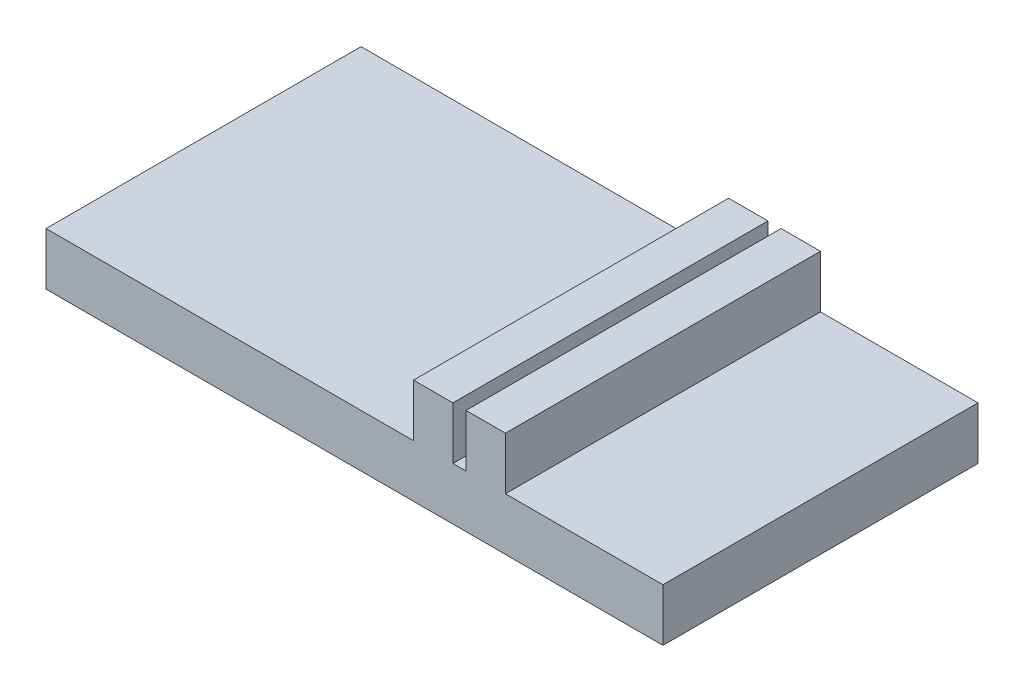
ISO-10303-21;
HEADER;
FILE_DESCRIPTION(('STEP AP214'),'2;1');
FILE_NAME('part.step','',(''),(''),'','','');
FILE_SCHEMA(('AUTOMOTIVE_DESIGN { 1 0 10303 214 1 1 1 1 }'));
ENDSEC;
DATA;
#1=APPLICATION_CONTEXT('core data for automotive mechanical design processes');
#2=APPLICATION_PROTOCOL_DEFINITION('international standard','automotive_design',2000,#1);
#3=PRODUCT_CONTEXT('',#1,'mechanical');
#4=PRODUCT('Part','Part','',(#3));
#5=PRODUCT_RELATED_PRODUCT_CATEGORY('part','',(#4));
#6=PRODUCT_DEFINITION_FORMATION('','',#4);
#7=PRODUCT_DEFINITION_CONTEXT('part definition',#1,'design');
#8=PRODUCT_DEFINITION('design','',#6,#7);
#9=PRODUCT_DEFINITION_SHAPE('','',#8);
#10=(LENGTH_UNIT() NAMED_UNIT(*) SI_UNIT(.MILLI.,.METRE.));
#11=(NAMED_UNIT(*) PLANE_ANGLE_UNIT() SI_UNIT($,.RADIAN.));
#12=(NAMED_UNIT(*) SI_UNIT($,.STERADIAN.) SOLID_ANGLE_UNIT());
#13=UNCERTAINTY_MEASURE_WITH_UNIT(LENGTH_MEASURE(1.E-05),#10,'distance_accuracy_value','');
#14=(GEOMETRIC_REPRESENTATION_CONTEXT(3) GLOBAL_UNCERTAINTY_ASSIGNED_CONTEXT((#13)) GLOBAL_UNIT_ASSIGNED_CONTEXT((#10,
#11,#12)) REPRESENTATION_CONTEXT('',''));
#15=CARTESIAN_POINT('',(0.,0.,0.));
#16=DIRECTION('',(0.,0.,1.));
#17=DIRECTION('',(1.,0.,0.));
#18=AXIS2_PLACEMENT_3D('',#15,#16,#17);
#19=CARTESIAN_POINT('',(0.,25.4,152.4));
#20=DIRECTION('',(1.,0.,0.));
#21=DIRECTION('',(0.,1.,0.));
#22=AXIS2_PLACEMENT_3D('',#19,#20,#21);
#23=PLANE('',#22);
#24=DIRECTION('',(0.,-1.,0.));
#25=VECTOR('',#24,1.);
#26=CARTESIAN_POINT('',(0.,25.4,0.));
#27=LINE('',#26,#25);
#28=CARTESIAN_POINT('',(0.,25.4,0.));
#29=VERTEX_POINT('',#28);
#30=CARTESIAN_POINT('',(0.,0.,0.));
#31=VERTEX_POINT('',#30);
#32=EDGE_CURVE('E153',#29,#31,#27,.T.);
#33=ORIENTED_EDGE('',*,*,#32,.T.);
#34=DIRECTION('',(0.,0.,-1.));
#35=VECTOR('',#34,1.);
#36=CARTESIAN_POINT('',(0.,0.,152.4));
#37=LINE('',#36,#35);
#38=CARTESIAN_POINT('',(0.,0.,152.4));
#39=VERTEX_POINT('',#38);
#40=EDGE_CURVE('E11',#39,#31,#37,.T.);
#41=ORIENTED_EDGE('',*,*,#40,.F.);
#42=DIRECTION('',(0.,-1.,0.));
#43=VECTOR('',#42,1.);
#44=CARTESIAN_POINT('',(0.,25.4,152.4));
#45=LINE('',#44,#43);
#46=CARTESIAN_POINT('',(0.,25.4,152.4));
#47=VERTEX_POINT('',#46);
#48=EDGE_CURVE('E175',#47,#39,#45,.T.);
#49=ORIENTED_EDGE('',*,*,#48,.F.);
#50=DIRECTION('',(0.,0.,-1.));
#51=VECTOR('',#50,1.);
#52=CARTESIAN_POINT('',(0.,25.4,152.4));
#53=LINE('',#52,#51);
#54=EDGE_CURVE('E149',#47,#29,#53,.T.);
#55=ORIENTED_EDGE('',*,*,#54,.T.);
#56=EDGE_LOOP('',(#33,#41,#49,#55));
#57=FACE_BOUND('',#56,.T.);
#58=ADVANCED_FACE('F33',(#57),#23,.F.);
#59=CARTESIAN_POINT('',(0.,0.,152.4));
#60=DIRECTION('',(0.,1.,0.));
#61=DIRECTION('',(0.,0.,1.));
#62=AXIS2_PLACEMENT_3D('',#59,#60,#61);
#63=PLANE('',#62);
#64=DIRECTION('',(1.,0.,0.));
#65=VECTOR('',#64,1.);
#66=CARTESIAN_POINT('',(0.,0.,0.));
#67=LINE('',#66,#65);
#68=CARTESIAN_POINT('',(298.45,0.,0.));
#69=VERTEX_POINT('',#68);
#70=EDGE_CURVE('E156',#31,#69,#67,.T.);
#71=ORIENTED_EDGE('',*,*,#70,.T.);
#72=DIRECTION('',(0.,0.,-1.));
#73=VECTOR('',#72,1.);
#74=CARTESIAN_POINT('',(298.45,0.,152.4));
#75=LINE('',#74,#73);
#76=CARTESIAN_POINT('',(298.45,0.,152.4));
#77=VERTEX_POINT('',#76);
#78=EDGE_CURVE('E41',#77,#69,#75,.T.);
#79=ORIENTED_EDGE('',*,*,#78,.F.);
#80=DIRECTION('',(1.,0.,0.));
#81=VECTOR('',#80,1.);
#82=CARTESIAN_POINT('',(0.,0.,152.4));
#83=LINE('',#82,#81);
#84=EDGE_CURVE('E104',#39,#77,#83,.T.);
#85=ORIENTED_EDGE('',*,*,#84,.F.);
#86=ORIENTED_EDGE('',*,*,#40,.T.);
#87=EDGE_LOOP('',(#71,#79,#85,#86));
#88=FACE_BOUND('',#87,.T.);
#89=ADVANCED_FACE('F253',(#88),#63,.F.);
#90=CARTESIAN_POINT('',(298.45,0.,152.4));
#91=DIRECTION('',(-1.,0.,0.));
#92=DIRECTION('',(0.,0.,1.));
#93=AXIS2_PLACEMENT_3D('',#90,#91,#92);
#94=PLANE('',#93);
#95=DIRECTION('',(0.,1.,0.));
#96=VECTOR('',#95,1.);
#97=CARTESIAN_POINT('',(298.45,0.,0.));
#98=LINE('',#97,#96);
#99=CARTESIAN_POINT('',(298.45,25.4,0.));
#100=VERTEX_POINT('',#99);
#101=EDGE_CURVE('E158',#69,#100,#98,.T.);
#102=ORIENTED_EDGE('',*,*,#101,.T.);
#103=DIRECTION('',(0.,0.,-1.));
#104=VECTOR('',#103,1.);
#105=CARTESIAN_POINT('',(298.45,25.4,152.4));
#106=LINE('',#105,#104);
#107=CARTESIAN_POINT('',(298.45,25.4,152.4));
#108=VERTEX_POINT('',#107);
#109=EDGE_CURVE('E194',#108,#100,#106,.T.);
#110=ORIENTED_EDGE('',*,*,#109,.F.);
#111=DIRECTION('',(0.,1.,0.));
#112=VECTOR('',#111,1.);
#113=CARTESIAN_POINT('',(298.45,0.,152.4));
#114=LINE('',#113,#112);
#115=EDGE_CURVE('E202',#77,#108,#114,.T.);
#116=ORIENTED_EDGE('',*,*,#115,.F.);
#117=ORIENTED_EDGE('',*,*,#78,.T.);
#118=EDGE_LOOP('',(#102,#110,#116,#117));
#119=FACE_BOUND('',#118,.T.);
#120=ADVANCED_FACE('F200',(#119),#94,.F.);
#121=CARTESIAN_POINT('',(298.45,25.4,152.4));
#122=DIRECTION('',(0.,-1.,0.));
#123=DIRECTION('',(1.,0.,0.));
#124=AXIS2_PLACEMENT_3D('',#121,#122,#123);
#125=PLANE('',#124);
#126=DIRECTION('',(-1.,0.,0.));
#127=VECTOR('',#126,1.);
#128=CARTESIAN_POINT('',(298.45,25.4,0.));
#129=LINE('',#128,#127);
#130=CARTESIAN_POINT('',(222.25,25.4,0.));
#131=VERTEX_POINT('',#130);
#132=EDGE_CURVE('E160',#100,#131,#129,.T.);
#133=ORIENTED_EDGE('',*,*,#132,.T.);
#134=DIRECTION('',(0.,0.,-1.));
#135=VECTOR('',#134,1.);
#136=CARTESIAN_POINT('',(222.25,25.4,152.4));
#137=LINE('',#136,#135);
#138=CARTESIAN_POINT('',(222.25,25.4,152.4));
#139=VERTEX_POINT('',#138);
#140=EDGE_CURVE('E191',#139,#131,#137,.T.);
#141=ORIENTED_EDGE('',*,*,#140,.F.);
#142=DIRECTION('',(-1.,0.,0.));
#143=VECTOR('',#142,1.);
#144=CARTESIAN_POINT('',(298.45,25.4,152.4));
#145=LINE('',#144,#143);
#146=EDGE_CURVE('E220',#108,#139,#145,.T.);
#147=ORIENTED_EDGE('',*,*,#146,.F.);
#148=ORIENTED_EDGE('',*,*,#109,.T.);
#149=EDGE_LOOP('',(#133,#141,#147,#148));
#150=FACE_BOUND('',#149,.T.);
#151=ADVANCED_FACE('F211',(#150),#125,.F.);
#152=CARTESIAN_POINT('',(222.25,25.4,152.4));
#153=DIRECTION('',(-1.,0.,0.));
#154=DIRECTION('',(0.,-1.,0.));
#155=AXIS2_PLACEMENT_3D('',#152,#153,#154);
#156=PLANE('',#155);
#157=DIRECTION('',(0.,1.,0.));
#158=VECTOR('',#157,1.);
#159=CARTESIAN_POINT('',(222.25,25.4,0.));
#160=LINE('',#159,#158);
#161=CARTESIAN_POINT('',(222.25,50.8,0.));
#162=VERTEX_POINT('',#161);
#163=EDGE_CURVE('E162',#131,#162,#160,.T.);
#164=ORIENTED_EDGE('',*,*,#163,.T.);
#165=DIRECTION('',(0.,0.,-1.));
#166=VECTOR('',#165,1.);
#167=CARTESIAN_POINT('',(222.25,50.8,152.4));
#168=LINE('',#167,#166);
#169=CARTESIAN_POINT('',(222.25,50.8,152.4));
#170=VERTEX_POINT('',#169);
#171=EDGE_CURVE('E188',#170,#162,#168,.T.);
#172=ORIENTED_EDGE('',*,*,#171,.F.);
#173=DIRECTION('',(0.,1.,0.));
#174=VECTOR('',#173,1.);
#175=CARTESIAN_POINT('',(222.25,25.4,152.4));
#176=LINE('',#175,#174);
#177=EDGE_CURVE('E217',#139,#170,#176,.T.);
#178=ORIENTED_EDGE('',*,*,#177,.F.);
#179=ORIENTED_EDGE('',*,*,#140,.T.);
#180=EDGE_LOOP('',(#164,#172,#178,#179));
#181=FACE_BOUND('',#180,.T.);
#182=ADVANCED_FACE('F215',(#181),#156,.F.);
#183=CARTESIAN_POINT('',(222.25,50.8,152.4));
#184=DIRECTION('',(0.,-1.,0.));
#185=DIRECTION('',(1.,0.,0.));
#186=AXIS2_PLACEMENT_3D('',#183,#184,#185);
#187=PLANE('',#186);
#188=DIRECTION('',(-1.,0.,0.));
#189=VECTOR('',#188,1.);
#190=CARTESIAN_POINT('',(222.25,50.8,0.));
#191=LINE('',#190,#189);
#192=CARTESIAN_POINT('',(203.2,50.8,0.));
#193=VERTEX_POINT('',#192);
#194=EDGE_CURVE('E164',#162,#193,#191,.T.);
#195=ORIENTED_EDGE('',*,*,#194,.T.);
#196=DIRECTION('',(0.,0.,-1.));
#197=VECTOR('',#196,1.);
#198=CARTESIAN_POINT('',(203.2,50.8,152.4));
#199=LINE('',#198,#197);
#200=CARTESIAN_POINT('',(203.2,50.8,152.4));
#201=VERTEX_POINT('',#200);
#202=EDGE_CURVE('E185',#201,#193,#199,.T.);
#203=ORIENTED_EDGE('',*,*,#202,.F.);
#204=DIRECTION('',(-1.,0.,0.));
#205=VECTOR('',#204,1.);
#206=CARTESIAN_POINT('',(222.25,50.8,152.4));
#207=LINE('',#206,#205);
#208=EDGE_CURVE('E219',#170,#201,#207,.T.);
#209=ORIENTED_EDGE('',*,*,#208,.F.);
#210=ORIENTED_EDGE('',*,*,#171,.T.);
#211=EDGE_LOOP('',(#195,#203,#209,#210));
#212=FACE_BOUND('',#211,.T.);
#213=ADVANCED_FACE('F266',(#212),#187,.F.);
#214=CARTESIAN_POINT('',(203.2,50.8,152.4));
#215=DIRECTION('',(1.,0.,0.));
#216=DIRECTION('',(0.,0.,-1.));
#217=AXIS2_PLACEMENT_3D('',#214,#215,#216);
#218=PLANE('',#217);
#219=DIRECTION('',(0.,-1.,0.));
#220=VECTOR('',#219,1.);
#221=CARTESIAN_POINT('',(203.2,50.8,0.));
#222=LINE('',#221,#220);
#223=CARTESIAN_POINT('',(203.2,25.4,0.));
#224=VERTEX_POINT('',#223);
#225=EDGE_CURVE('E166',#193,#224,#222,.T.);
#226=ORIENTED_EDGE('',*,*,#225,.T.);
#227=DIRECTION('',(0.,0.,-1.));
#228=VECTOR('',#227,1.);
#229=CARTESIAN_POINT('',(203.2,25.4,152.4));
#230=LINE('',#229,#228);
#231=CARTESIAN_POINT('',(203.2,25.4,152.4));
#232=VERTEX_POINT('',#231);
#233=EDGE_CURVE('E182',#232,#224,#230,.T.);
#234=ORIENTED_EDGE('',*,*,#233,.F.);
#235=DIRECTION('',(0.,-1.,0.));
#236=VECTOR('',#235,1.);
#237=CARTESIAN_POINT('',(203.2,50.8,152.4));
#238=LINE('',#237,#236);
#239=EDGE_CURVE('E222',#201,#232,#238,.T.);
#240=ORIENTED_EDGE('',*,*,#239,.F.);
#241=ORIENTED_EDGE('',*,*,#202,.T.);
#242=EDGE_LOOP('',(#226,#234,#240,#241));
#243=FACE_BOUND('',#242,.T.);
#244=ADVANCED_FACE('F269',(#243),#218,.F.);
#245=CARTESIAN_POINT('',(203.2,25.4,152.4));
#246=DIRECTION('',(0.,-1.,0.));
#247=DIRECTION('',(0.,0.,-1.));
#248=AXIS2_PLACEMENT_3D('',#245,#246,#247);
#249=PLANE('',#248);
#250=DIRECTION('',(-1.,0.,0.));
#251=VECTOR('',#250,1.);
#252=CARTESIAN_POINT('',(203.2,25.4,0.));
#253=LINE('',#252,#251);
#254=CARTESIAN_POINT('',(196.85,25.4,0.));
#255=VERTEX_POINT('',#254);
#256=EDGE_CURVE('E168',#224,#255,#253,.T.);
#257=ORIENTED_EDGE('',*,*,#256,.T.);
#258=DIRECTION('',(0.,0.,-1.));
#259=VECTOR('',#258,1.);
#260=CARTESIAN_POINT('',(196.85,25.4,152.4));
#261=LINE('',#260,#259);
#262=CARTESIAN_POINT('',(196.85,25.4,152.4));
#263=VERTEX_POINT('',#262);
#264=EDGE_CURVE('E179',#263,#255,#261,.T.);
#265=ORIENTED_EDGE('',*,*,#264,.F.);
#266=DIRECTION('',(-1.,0.,0.));
#267=VECTOR('',#266,1.);
#268=CARTESIAN_POINT('',(203.2,25.4,152.4));
#269=LINE('',#268,#267);
#270=EDGE_CURVE('E228',#232,#263,#269,.T.);
#271=ORIENTED_EDGE('',*,*,#270,.F.);
#272=ORIENTED_EDGE('',*,*,#233,.T.);
#273=EDGE_LOOP('',(#257,#265,#271,#272));
#274=FACE_BOUND('',#273,.T.);
#275=ADVANCED_FACE('F234',(#274),#249,.F.);
#276=CARTESIAN_POINT('',(196.85,25.4,152.4));
#277=DIRECTION('',(-1.,0.,0.));
#278=DIRECTION('',(0.,0.,1.));
#279=AXIS2_PLACEMENT_3D('',#276,#277,#278);
#280=PLANE('',#279);
#281=DIRECTION('',(0.,1.,0.));
#282=VECTOR('',#281,1.);
#283=CARTESIAN_POINT('',(196.85,25.4,0.));
#284=LINE('',#283,#282);
#285=CARTESIAN_POINT('',(196.85,50.8,0.));
#286=VERTEX_POINT('',#285);
#287=EDGE_CURVE('E170',#255,#286,#284,.T.);
#288=ORIENTED_EDGE('',*,*,#287,.T.);
#289=DIRECTION('',(0.,0.,-1.));
#290=VECTOR('',#289,1.);
#291=CARTESIAN_POINT('',(196.85,50.8,152.4));
#292=LINE('',#291,#290);
#293=CARTESIAN_POINT('',(196.85,50.8,152.4));
#294=VERTEX_POINT('',#293);
#295=EDGE_CURVE('E144',#294,#286,#292,.T.);
#296=ORIENTED_EDGE('',*,*,#295,.F.);
#297=DIRECTION('',(0.,1.,0.));
#298=VECTOR('',#297,1.);
#299=CARTESIAN_POINT('',(196.85,25.4,152.4));
#300=LINE('',#299,#298);
#301=EDGE_CURVE('E135',#263,#294,#300,.T.);
#302=ORIENTED_EDGE('',*,*,#301,.F.);
#303=ORIENTED_EDGE('',*,*,#264,.T.);
#304=EDGE_LOOP('',(#288,#296,#302,#303));
#305=FACE_BOUND('',#304,.T.);
#306=ADVANCED_FACE('F238',(#305),#280,.F.);
#307=CARTESIAN_POINT('',(196.85,50.8,152.4));
#308=DIRECTION('',(0.,-1.,0.));
#309=DIRECTION('',(1.,0.,0.));
#310=AXIS2_PLACEMENT_3D('',#307,#308,#309);
#311=PLANE('',#310);
#312=DIRECTION('',(-1.,0.,0.));
#313=VECTOR('',#312,1.);
#314=CARTESIAN_POINT('',(196.85,50.8,0.));
#315=LINE('',#314,#313);
#316=CARTESIAN_POINT('',(177.8,50.8,0.));
#317=VERTEX_POINT('',#316);
#318=EDGE_CURVE('E143',#286,#317,#315,.T.);
#319=ORIENTED_EDGE('',*,*,#318,.T.);
#320=DIRECTION('',(0.,0.,-1.));
#321=VECTOR('',#320,1.);
#322=CARTESIAN_POINT('',(177.8,50.8,152.4));
#323=LINE('',#322,#321);
#324=CARTESIAN_POINT('',(177.8,50.8,152.4));
#325=VERTEX_POINT('',#324);
#326=EDGE_CURVE('E140',#325,#317,#323,.T.);
#327=ORIENTED_EDGE('',*,*,#326,.F.);
#328=DIRECTION('',(-1.,0.,0.));
#329=VECTOR('',#328,1.);
#330=CARTESIAN_POINT('',(196.85,50.8,152.4));
#331=LINE('',#330,#329);
#332=EDGE_CURVE('E129',#294,#325,#331,.T.);
#333=ORIENTED_EDGE('',*,*,#332,.F.);
#334=ORIENTED_EDGE('',*,*,#295,.T.);
#335=EDGE_LOOP('',(#319,#327,#333,#334));
#336=FACE_BOUND('',#335,.T.);
#337=ADVANCED_FACE('F141',(#336),#311,.F.);
#338=CARTESIAN_POINT('',(177.8,50.8,152.4));
#339=DIRECTION('',(1.,0.,0.));
#340=DIRECTION('',(0.,1.,0.));
#341=AXIS2_PLACEMENT_3D('',#338,#339,#340);
#342=PLANE('',#341);
#343=DIRECTION('',(0.,-1.,0.));
#344=VECTOR('',#343,1.);
#345=CARTESIAN_POINT('',(177.8,50.8,0.));
#346=LINE('',#345,#344);
#347=CARTESIAN_POINT('',(177.8,25.4,0.));
#348=VERTEX_POINT('',#347);
#349=EDGE_CURVE('E90',#317,#348,#346,.T.);
#350=ORIENTED_EDGE('',*,*,#349,.T.);
#351=DIRECTION('',(0.,0.,-1.));
#352=VECTOR('',#351,1.);
#353=CARTESIAN_POINT('',(177.8,25.4,152.4));
#354=LINE('',#353,#352);
#355=CARTESIAN_POINT('',(177.8,25.4,152.4));
#356=VERTEX_POINT('',#355);
#357=EDGE_CURVE('E145',#356,#348,#354,.T.);
#358=ORIENTED_EDGE('',*,*,#357,.F.);
#359=DIRECTION('',(0.,-1.,0.));
#360=VECTOR('',#359,1.);
#361=CARTESIAN_POINT('',(177.8,50.8,152.4));
#362=LINE('',#361,#360);
#363=EDGE_CURVE('E133',#325,#356,#362,.T.);
#364=ORIENTED_EDGE('',*,*,#363,.F.);
#365=ORIENTED_EDGE('',*,*,#326,.T.);
#366=EDGE_LOOP('',(#350,#358,#364,#365));
#367=FACE_BOUND('',#366,.T.);
#368=ADVANCED_FACE('F147',(#367),#342,.F.);
#369=CARTESIAN_POINT('',(177.8,25.4,152.4));
#370=DIRECTION('',(0.,-1.,0.));
#371=DIRECTION('',(1.,0.,0.));
#372=AXIS2_PLACEMENT_3D('',#369,#370,#371);
#373=PLANE('',#372);
#374=DIRECTION('',(-1.,0.,0.));
#375=VECTOR('',#374,1.);
#376=CARTESIAN_POINT('',(177.8,25.4,0.));
#377=LINE('',#376,#375);
#378=EDGE_CURVE('E96',#348,#29,#377,.T.);
#379=ORIENTED_EDGE('',*,*,#378,.T.);
#380=ORIENTED_EDGE('',*,*,#54,.F.);
#381=DIRECTION('',(-1.,0.,0.));
#382=VECTOR('',#381,1.);
#383=CARTESIAN_POINT('',(177.8,25.4,152.4));
#384=LINE('',#383,#382);
#385=EDGE_CURVE('E49',#356,#47,#384,.T.);
#386=ORIENTED_EDGE('',*,*,#385,.F.);
#387=ORIENTED_EDGE('',*,*,#357,.T.);
#388=EDGE_LOOP('',(#379,#380,#386,#387));
#389=FACE_BOUND('',#388,.T.);
#390=ADVANCED_FACE('F242',(#389),#373,.F.);
#391=CARTESIAN_POINT('',(0.,0.,152.4));
#392=DIRECTION('',(0.,0.,1.));
#393=DIRECTION('',(1.,0.,0.));
#394=AXIS2_PLACEMENT_3D('',#391,#392,#393);
#395=PLANE('',#394);
#396=ORIENTED_EDGE('',*,*,#48,.T.);
#397=ORIENTED_EDGE('',*,*,#84,.T.);
#398=ORIENTED_EDGE('',*,*,#115,.T.);
#399=ORIENTED_EDGE('',*,*,#146,.T.);
#400=ORIENTED_EDGE('',*,*,#177,.T.);
#401=ORIENTED_EDGE('',*,*,#208,.T.);
#402=ORIENTED_EDGE('',*,*,#239,.T.);
#403=ORIENTED_EDGE('',*,*,#270,.T.);
#404=ORIENTED_EDGE('',*,*,#301,.T.);
#405=ORIENTED_EDGE('',*,*,#332,.T.);
#406=ORIENTED_EDGE('',*,*,#363,.T.);
#407=ORIENTED_EDGE('',*,*,#385,.T.);
#408=EDGE_LOOP('',(#396,#397,#398,#399,#400,#401,#402,#403,#404,#405,#406,#407));
#409=FACE_BOUND('',#408,.T.);
#410=ADVANCED_FACE('F131',(#409),#395,.T.);
#411=CARTESIAN_POINT('',(0.,0.,0.));
#412=DIRECTION('',(0.,0.,1.));
#413=DIRECTION('',(1.,0.,0.));
#414=AXIS2_PLACEMENT_3D('',#411,#412,#413);
#415=PLANE('',#414);
#416=ORIENTED_EDGE('',*,*,#32,.F.);
#417=ORIENTED_EDGE('',*,*,#378,.F.);
#418=ORIENTED_EDGE('',*,*,#349,.F.);
#419=ORIENTED_EDGE('',*,*,#318,.F.);
#420=ORIENTED_EDGE('',*,*,#287,.F.);
#421=ORIENTED_EDGE('',*,*,#256,.F.);
#422=ORIENTED_EDGE('',*,*,#225,.F.);
#423=ORIENTED_EDGE('',*,*,#194,.F.);
#424=ORIENTED_EDGE('',*,*,#163,.F.);
#425=ORIENTED_EDGE('',*,*,#132,.F.);
#426=ORIENTED_EDGE('',*,*,#101,.F.);
#427=ORIENTED_EDGE('',*,*,#70,.F.);
#428=EDGE_LOOP('',(#416,#417,#418,#419,#420,#421,#422,#423,#424,#425,#426,#427));
#429=FACE_BOUND('',#428,.T.);
#430=ADVANCED_FACE('F206',(#429),#415,.F.);
#431=CLOSED_SHELL('',(#58,#89,#120,#151,#182,#213,#244,#275,#306,#337,#368,#390,#410,#430));
#432=MANIFOLD_SOLID_BREP('B2',#431);
#433=ADVANCED_BREP_SHAPE_REPRESENTATION('',(#18,#432),#14);
#434=SHAPE_DEFINITION_REPRESENTATION(#9,#433);
ENDSEC;
END-ISO-10303-21;
